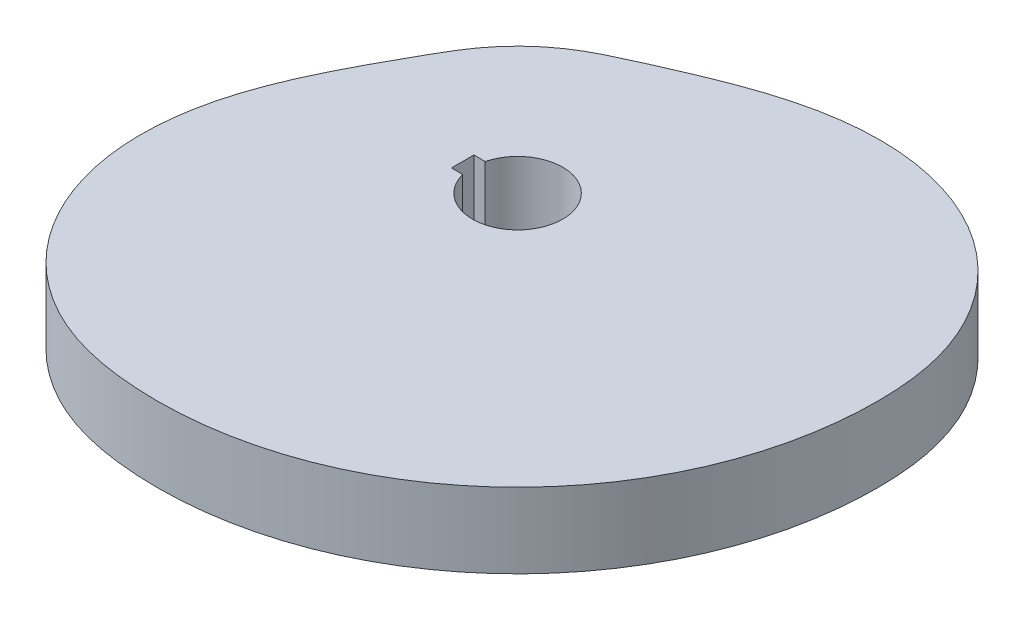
from build123d import *

# Parameters (mm, degrees)
SKETCH1_R                      = 158.75
SKETCH1_R_2                    = 19.0754
DISC_CW_INSIDE_ONCENTER_DEPTH  = 31.75
KEYWAY_0_3750_X_0_3750IN_DEPTH = 227.740352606
SINGLE_SURFACE_SKETCH_R        = 158.75
SINGLE_SURFACE_DEPTH           = 33.02


with BuildPart() as part:
    # Sketch1 → Disc_ CW_ Inside_ OnCenter (new body)
    with BuildSketch(Plane(origin=(0, 0, 0), x_dir=(1, 0, 0), z_dir=(0, 1, 0))):
        with Locations(Location((0, 0, 0), (0, 0, 270))):
            Circle(SKETCH1_R)
        with Locations(Location((0, 0, 0), (0, 0, 270))):
            Circle(SKETCH1_R_2, mode=Mode.SUBTRACT)
    extrude(amount=-DISC_CW_INSIDE_ONCENTER_DEPTH)

    # Sketch6 → Keyway_ 0.3750 x 0.3750in (cut, through all)
    with BuildSketch(Plane(origin=(0, 0, 0), x_dir=(1, 0, 0), z_dir=(0, 1, 0))):
        with BuildLine():
            Line((-18.471315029, 4.7625), (-23.233815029, 4.7625))
            Line((-23.233815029, 4.7625), (-23.233815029, -4.7625))
            Line((-23.233815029, -4.7625), (-18.471315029, -4.7625))
            ThreePointArc((-18.471315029, -4.7625), (19.0754, 0), (-18.471315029, 4.7625))
        make_face()
    extrude(amount=-KEYWAY_0_3750_X_0_3750IN_DEPTH, mode=Mode.SUBTRACT)

    # Single Surface Sketch → Single Surface (cut)
    with BuildSketch(Plane(origin=(0, 0, 0), x_dir=(1, 0, 0), z_dir=(0, 1, 0))):
        Circle(SINGLE_SURFACE_SKETCH_R)
        with BuildLine():
            add(Edge.make_bspline(
                [(152.4, 0), (152.400005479, 0.970305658), (152.382430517, 2.813936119), (152.303857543, 5.521653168), (152.1779675, 8.114291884), (152.000701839, 10.679978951), (151.770703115, 13.218306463), (151.48673893, 15.72898066), (151.147703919, 18.211824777), (150.752617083, 20.666777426), (150.300616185, 23.093888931), (149.79095648, 25.493316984), (149.222988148, 27.865312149), (148.596212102, 30.210228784), (147.910048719, 32.528430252), (147.167888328, 34.810706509), (146.361577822, 37.076611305), (145.497122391, 39.316987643), (144.56880812, 41.539622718), (143.586255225, 43.724170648), (142.546194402, 45.878623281), (141.449579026, 48.001467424), (140.297381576, 50.091208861), (139.090644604, 52.14639408), (137.83046529, 54.165607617), (136.517997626, 56.147475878), (135.154449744, 58.090669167), (133.741082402, 59.993904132), (132.279207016, 61.855946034), (130.770183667, 63.67561099), (129.215418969, 65.451768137), (127.616363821, 67.183341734), (125.974511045, 68.869313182), (124.291392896, 70.50872296), (122.568578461, 72.100672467), (120.807670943, 73.64432576), (119.010304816, 75.138911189), (117.178142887, 76.583722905), (115.312873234, 77.97812225), (113.416206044, 79.321539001), (111.489870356, 80.613472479), (109.535610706, 81.853492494), (107.555183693, 83.041240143), (105.550354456, 84.176428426), (103.5228931, 85.258842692), (101.474571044, 86.288340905), (99.407157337, 87.264853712), (97.322414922, 88.188384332), (95.222096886, 89.059008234), (93.107942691, 89.87687262), (90.981674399, 90.642195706), (88.844992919, 91.355265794), (86.69957427, 92.016440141), (84.547065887, 92.626143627), (82.389082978, 93.184867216), (80.227204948, 93.693166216), (78.062971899, 94.151658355), (75.897881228, 94.561021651), (73.733384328, 94.921992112), (71.570883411, 95.235361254), (69.411728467, 95.501973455), (67.257214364, 95.722723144), (65.108578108, 95.898551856), (62.966996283, 96.030445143), (60.833582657, 96.119429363), (58.709386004, 96.166568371), (56.595388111, 96.172960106), (54.492502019, 96.139733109), (52.401570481, 96.068042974), (50.323364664, 95.959068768), (48.258583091, 95.814009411), (46.207850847, 95.634080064), (44.171719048, 95.420508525), (42.150664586, 95.174531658), (40.145090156, 94.897391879), (38.155324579, 94.590333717), (36.181623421, 94.254600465), (34.224169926, 93.891430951), (32.283076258, 93.502056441), (30.358385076, 93.087697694), (28.450071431, 92.649562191), (26.558045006, 92.188841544), (24.682152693, 91.706709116), (22.822181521, 91.204317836), (20.977861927, 90.682798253), (19.148871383, 90.143256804), (17.334838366, 89.586774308), (15.535346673, 89.014404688), (13.749940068, 88.427173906), (11.978127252, 87.82607909), (10.219387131, 87.212087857), (8.473174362, 86.586137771), (6.738925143, 85.949135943), (5.016063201, 85.301958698), (3.304005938, 84.645451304), (1.602170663, 83.980427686), (-0.090019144, 83.307670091), (-1.773127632, 82.627928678), (-3.447700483, 81.941920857), (-5.114259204, 81.250330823), (-6.773295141, 80.553807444), (-8.425266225, 79.852967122), (-10.070585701, 79.14837697), (-11.709643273, 78.440609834), (-13.342708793, 77.730030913), (-14.954278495, 77.024583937), (-16.575580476, 76.309029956), (-18.190621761, 75.594020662), (-19.812157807, 74.872115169), (-21.404850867, 74.159354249), (-22.980820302, 73.449719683), (-24.536212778, 72.744126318), (-26.067187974, 72.043165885), (-27.570003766, 71.347165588), (-29.041075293, 70.656207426), (-30.477033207, 69.970168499), (-31.874772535, 69.288762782), (-33.231493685, 68.611585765), (-34.544735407, 67.938156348), (-35.812400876, 67.267957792), (-36.993839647, 66.62175636), (-38.173705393, 65.953078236), (-39.324080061, 65.274090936), (-40.494627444, 64.553968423), (-41.615082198, 63.837406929), (-42.722860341, 63.1014011), (-43.817624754, 62.346173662), (-44.899041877, 61.571955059), (-45.966782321, 60.77898102), (-47.020520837, 59.96749312), (-48.059936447, 59.13773854), (-49.084712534, 58.289970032), (-50.094536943, 57.424445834), (-51.089102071, 56.541429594), (-52.068104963, 55.641190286), (-53.031247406, 54.724002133), (-53.978236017, 53.790144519), (-54.908782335, 52.839901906), (-55.822602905, 51.873563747), (-56.71941937, 50.891424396), (-57.598958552, 49.893783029), (-58.460952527, 48.880943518), (-59.30513875, 47.853214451), (-60.13125998, 46.810908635), (-60.939064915, 45.754344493), (-61.701998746, 44.719523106), (-62.478437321, 43.628995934), (-63.248698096, 42.505697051), (-64.045795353, 41.301727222), (-64.825337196, 40.088119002), (-65.612140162, 38.829788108), (-66.406525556, 37.528940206), (-67.208739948, 36.18813836), (-68.018916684, 34.810268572), (-68.837036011, 33.398502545), (-69.66288569, 31.9562517), (-70.496019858, 30.487110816), (-71.335743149, 28.994804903), (-72.181031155, 27.483090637), (-73.03073756, 25.955806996), (-73.891251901, 24.401027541), (-74.745821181, 22.853724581), (-75.598320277, 21.298945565), (-76.4416129, 19.754086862), (-77.29131105, 18.187902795), (-78.138776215, 16.615509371), (-78.983487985, 15.03650085), (-79.824948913, 13.450455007), (-80.662610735, 11.856895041), (-81.49589608, 10.255304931), (-82.324194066, 8.645131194), (-83.146862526, 7.02578893), (-83.963228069, 5.396667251), (-84.772586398, 3.757135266), (-85.574202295, 2.106548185), (-86.367309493, 0.444253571), (-87.151110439, -1.230402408), (-87.924776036, -2.918068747), (-88.68744539, -4.61938349), (-89.438225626, -6.334967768), (-90.176191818, -8.065420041), (-90.900387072, -9.811310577), (-91.609822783, -11.5731762), (-92.303479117, -13.351515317), (-92.980305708, -15.146783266), (-93.639222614, -16.959387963), (-94.279121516, -18.789685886), (-94.898867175, -20.637978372), (-95.497299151, -22.504508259), (-96.073233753, -24.389456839), (-96.625466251, -26.292941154), (-97.152773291, -28.2150116), (-97.653915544, -30.155649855), (-98.127640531, -32.114767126), (-98.572685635, -34.092202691), (-98.987781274, -36.087722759), (-99.371654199, -38.10101961), (-99.723030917, -40.131711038), (-100.040641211, -42.179340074), (-100.323221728, -44.243374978), (-100.569519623, -46.323209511), (-100.778296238, -48.418163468), (-100.948330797, -50.527483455), (-101.078424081, -52.65034393), (-101.167402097, -54.785848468), (-101.214119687, -56.933031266), (-101.217464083, -59.09085886), (-101.176358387, -61.258232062), (-101.08976495, -63.433988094), (-100.956688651, -65.616902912), (-100.776180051, -67.805693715), (-100.547338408, -69.999021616), (-100.269314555, -72.195494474), (-99.941313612, -74.393669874), (-99.562597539, -76.592058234), (-99.132487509, -78.789126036), (-98.650366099, -80.983299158), (-98.115679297, -83.17296631), (-97.527938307, -85.35648254), (-96.886721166, -87.532172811), (-96.191674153, -89.698335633), (-95.442512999, -91.853246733), (-94.639023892, -93.995162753), (-93.781064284, -96.122324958), (-92.868563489, -98.232962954), (-91.901523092, -100.325298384), (-90.880017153, -102.397548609), (-89.804192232, -104.447930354), (-88.67426721, -106.474663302), (-87.490532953, -108.475973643), (-86.25335178, -110.450097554), (-84.963156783, -112.395284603), (-83.620450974, -114.309801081), (-82.22580629, -116.191933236), (-80.779862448, -118.039990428), (-79.283325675, -119.852308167), (-77.736967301, -121.627251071), (-76.141622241, -123.363215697), (-74.498187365, -125.058633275), (-72.807619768, -126.711972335), (-71.070934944, -128.321741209), (-69.289204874, -129.886490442), (-67.463556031, -131.404815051), (-65.595167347, -132.875356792), (-63.685267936, -134.296805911), (-61.73513545, -135.667904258), (-59.74609176, -136.987442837), (-57.719508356, -138.254279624), (-55.656775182, -139.467281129), (-53.55940591, -140.625548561), (-51.419377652, -141.732366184), (-49.257298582, -142.778910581), (-47.063397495, -143.766659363), (-44.84849589, -144.693914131), (-42.592553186, -145.568021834), (-40.304805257, -146.385524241), (-37.984873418, -147.146870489), (-35.632488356, -147.852655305), (-33.247471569, -148.503554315), (-30.829754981, -149.100347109), (-28.379387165, -149.643917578), (-25.896539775, -150.135260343), (-23.38151082, -150.575484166), (-20.83472494, -150.965814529), (-18.256735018, -151.307590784), (-15.736285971, -151.592320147), (-13.103256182, -151.843403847), (-10.454561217, -152.049548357), (-7.710756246, -152.21255683), (-5.053105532, -152.323946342), (-2.393916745, -152.388935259), (0.266001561, -152.407505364), (2.925838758, -152.379650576), (5.584784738, -152.305379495), (8.242029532, -152.184714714), (10.896763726, -152.017692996), (13.54817866, -151.804365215), (16.195466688, -151.544796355), (18.837821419, -151.239065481), (21.474437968, -150.887265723), (24.104513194, -150.489504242), (26.727245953, -150.045902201), (29.341837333, -149.556594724), (31.947490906, -149.021730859), (34.543412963, -148.441473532), (37.128812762, -147.815999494), (39.702902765, -147.14549927), (42.26489888, -146.430177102), (44.814020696, -145.670250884), (47.349491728, -144.865952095), (49.870539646, -144.017525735), (52.376396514, -143.125230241), (54.866299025, -142.189337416), (57.33948873, -141.210132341), (59.795212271, -140.187913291), (62.23272161, -139.122991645), (64.65127426, -138.015691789), (67.050133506, -136.866351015), (69.428568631, -135.675319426), (71.785855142, -134.442959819), (74.121274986, -133.169647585), (76.434116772, -131.855770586), (78.723675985, -130.501729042), (80.989255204, -129.107935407), (83.230164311, -127.674814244), (85.445720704, -126.202802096), (87.635249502, -124.692347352), (89.798083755, -123.143910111), (91.933564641, -121.557962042), (94.041041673, -119.93498624), (96.119872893, -118.27547708), (98.169425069, -116.579940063), (100.189073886, -114.848891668), (102.178204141, -113.082859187), (104.136209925, -111.282380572), (106.062494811, -109.448004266), (107.956472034, -107.580289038), (109.817564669, -105.679803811), (111.64520581, -103.747127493), (113.43883874, -101.782848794), (115.197917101, -99.787566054), (116.921905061, -97.761887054), (118.610277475, -95.706428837), (120.26252005, -93.621817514), (121.878129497, -91.508688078), (123.456613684, -89.36768421), (124.997491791, -87.19945808), (126.500294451, -85.00467015), (127.964563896, -82.783988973), (129.389854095, -80.538090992), (130.775730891, -78.267660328), (132.121772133, -75.973388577), (133.427567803, -73.655974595), (134.692720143, -71.31612429), (135.916843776, -68.954550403), (137.099565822, -66.571972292), (138.240526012, -64.169115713), (139.339376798, -61.7467126), (140.395783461, -59.30550084), (141.409424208, -56.84622405), (142.379990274, -54.369631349), (143.307186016, -51.876477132), (144.190729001, -49.367520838), (145.030350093, -46.843526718), (145.825793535, -44.305263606), (146.576817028, -41.753504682), (147.283191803, -39.189027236), (147.944702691, -36.612612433), (148.561148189, -34.025045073), (149.132340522, -31.427113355), (149.6581057, -28.819608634), (150.138283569, -26.20332518), (150.572727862, -23.57905994), (150.961306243, -20.947612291), (151.30390035, -18.309783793), (151.600405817, -15.666377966), (151.850732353, -13.018199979), (152.054803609, -10.366056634), (152.21255778, -7.710755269), (152.323945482, -5.053106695), (152.386771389, -2.482550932), (152.399995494, -0.797967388), (152.4, 0)],
                knots=[0, 0, 0, 0, 0.003678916, 0.006990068, 0.010270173, 0.013519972, 0.016740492, 0.019933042, 0.023099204, 0.02624082, 0.029359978, 0.032458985, 0.035540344, 0.038606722, 0.041660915, 0.044705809, 0.047704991, 0.050778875, 0.053809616, 0.056836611, 0.059859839, 0.062879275, 0.065894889, 0.068906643, 0.071914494, 0.07491839, 0.077918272, 0.080914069, 0.083905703, 0.086893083, 0.089876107, 0.092854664, 0.095828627, 0.098797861, 0.101762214, 0.104721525, 0.107675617, 0.110624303, 0.113567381, 0.116504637, 0.119435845, 0.122360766, 0.125279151, 0.128190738, 0.131095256, 0.133992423, 0.136881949, 0.139763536, 0.142636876, 0.145501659, 0.148357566, 0.151204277, 0.154041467, 0.15686881, 0.159685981, 0.162492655, 0.165288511, 0.16807323, 0.170846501, 0.17360802, 0.176357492, 0.179094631, 0.181819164, 0.184530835, 0.187229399, 0.189914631, 0.192586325, 0.195244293, 0.197888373, 0.200518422, 0.203134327, 0.205735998, 0.208323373, 0.210896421, 0.213455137, 0.21599955, 0.21852972, 0.221045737, 0.223547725, 0.22603584, 0.228510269, 0.230971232, 0.233418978, 0.235853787, 0.238275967, 0.240685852, 0.2430838, 0.245470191, 0.247845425, 0.250209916, 0.252564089, 0.254908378, 0.257243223, 0.259569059, 0.261886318, 0.264195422, 0.266496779, 0.268790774, 0.271077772, 0.273358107, 0.275632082, 0.277899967, 0.280161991, 0.282418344, 0.284669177, 0.2869146, 0.289088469, 0.291388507, 0.293611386, 0.295818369, 0.298004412, 0.300164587, 0.302294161, 0.304388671, 0.306443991, 0.308456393, 0.310422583, 0.312339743, 0.314205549, 0.316018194, 0.317776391, 0.319311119, 0.321160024, 0.322840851, 0.324521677, 0.326202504, 0.327883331, 0.329564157, 0.331244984, 0.332925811, 0.334606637, 0.336287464, 0.337968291, 0.339649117, 0.341329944, 0.343010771, 0.344691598, 0.346372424, 0.348053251, 0.349734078, 0.351414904, 0.353095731, 0.354776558, 0.356457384, 0.358138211, 0.359819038, 0.361331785, 0.363213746, 0.36498291, 0.366806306, 0.368682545, 0.370609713, 0.372585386, 0.37460665, 0.37667012, 0.378771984, 0.380908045, 0.38307378, 0.38526441, 0.387474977, 0.389700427, 0.392002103, 0.394176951, 0.396423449, 0.398675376, 0.400932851, 0.40319603, 0.405465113, 0.407740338, 0.41002198, 0.41231035, 0.414605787, 0.416908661, 0.419219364, 0.421538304, 0.423865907, 0.426202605, 0.428548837, 0.430905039, 0.433271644, 0.435649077, 0.438037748, 0.440438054, 0.44285037, 0.44527505, 0.447712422, 0.45016279, 0.452626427, 0.455103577, 0.457594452, 0.460099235, 0.462618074, 0.465151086, 0.467698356, 0.470259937, 0.472835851, 0.475426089, 0.478030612, 0.480649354, 0.48328222, 0.485929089, 0.488589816, 0.491264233, 0.493952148, 0.496653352, 0.499367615, 0.502094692, 0.504834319, 0.507586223, 0.510350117, 0.513125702, 0.515912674, 0.518710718, 0.521519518, 0.524338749, 0.527168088, 0.530007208, 0.532855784, 0.535713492, 0.538580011, 0.541455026, 0.544338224, 0.547229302, 0.550127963, 0.553033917, 0.555946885, 0.558866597, 0.561792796, 0.564725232, 0.56766367, 0.570607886, 0.573557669, 0.576512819, 0.579473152, 0.582438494, 0.585408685, 0.588383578, 0.591363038, 0.594346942, 0.59733518, 0.600327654, 0.603324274, 0.606324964, 0.609329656, 0.612338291, 0.61535082, 0.618367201, 0.621387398, 0.624411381, 0.627439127, 0.630470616, 0.633545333, 0.63654548, 0.639591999, 0.642648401, 0.645717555, 0.648802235, 0.651905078, 0.655028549, 0.658174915, 0.661346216, 0.664544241, 0.667770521, 0.671026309, 0.674312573, 0.677629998, 0.680642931, 0.68434074, 0.687702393, 0.691064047, 0.6944257, 0.697787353, 0.701149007, 0.70451066, 0.707872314, 0.711233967, 0.71459562, 0.717957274, 0.721318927, 0.724680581, 0.728042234, 0.731403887, 0.734765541, 0.738127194, 0.741488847, 0.744850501, 0.748212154, 0.751573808, 0.754935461, 0.758297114, 0.761658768, 0.765020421, 0.768382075, 0.771743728, 0.775105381, 0.778467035, 0.781828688, 0.785190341, 0.788551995, 0.791913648, 0.795275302, 0.798636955, 0.801998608, 0.805360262, 0.808721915, 0.812083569, 0.815445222, 0.818806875, 0.822168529, 0.825530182, 0.828891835, 0.832253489, 0.835615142, 0.838976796, 0.842338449, 0.845700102, 0.849061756, 0.852423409, 0.855785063, 0.859146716, 0.862508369, 0.865870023, 0.869231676, 0.872593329, 0.875954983, 0.879316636, 0.88267829, 0.886039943, 0.889401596, 0.89276325, 0.896124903, 0.899486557, 0.90284821, 0.906209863, 0.909571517, 0.91293317, 0.916294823, 0.919656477, 0.92301813, 0.926379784, 0.929741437, 0.93310309, 0.936464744, 0.939826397, 0.943188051, 0.946549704, 0.949911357, 0.953273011, 0.956634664, 0.959996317, 0.963357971, 0.966719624, 0.970081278, 0.973442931, 0.976804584, 0.980166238, 0.983527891, 0.986889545, 0.990251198, 0.993612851, 0.996974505, 1, 1, 1, 1], degree=3))
        make_face(mode=Mode.SUBTRACT)
    extrude(amount=-SINGLE_SURFACE_DEPTH, mode=Mode.SUBTRACT)


solid = part.part
